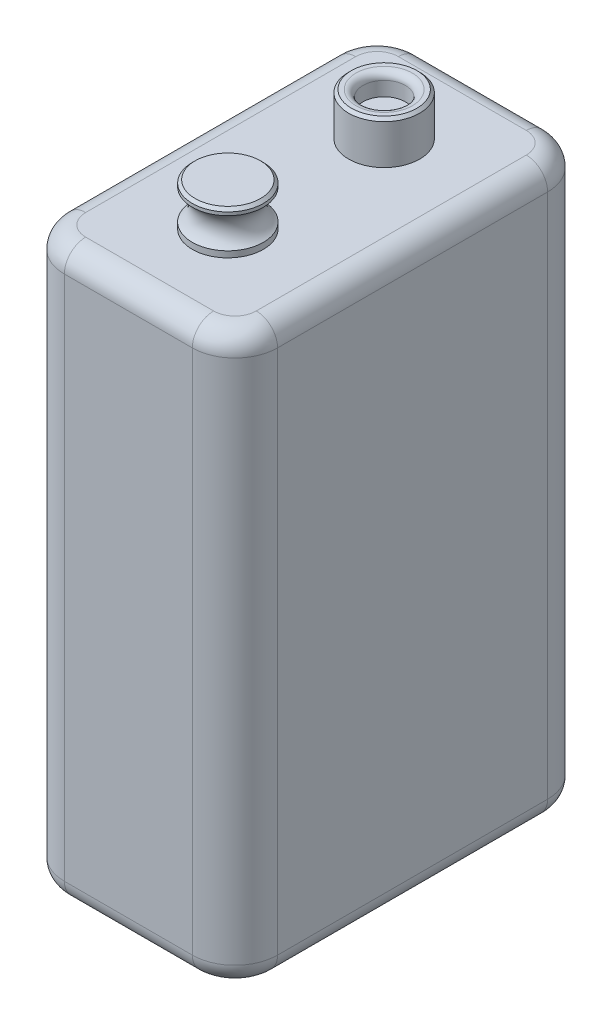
from build123d import *

# Parameters (mm, degrees)
CROQUIS1_W              = 15
CROQUIS1_H              = 25
SALIENTE_EXTRUIR1_DEPTH = 40
REDONDEO1_R             = 3
REDONDEO2_R             = 1.5
REDONDEO3_R             = 1.5
CROQUIS2_R              = 2.5
SALIENTE_EXTRUIR2_DEPTH = 3
CROQUIS3_R              = 1.487403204
CORTAR_EXTRUIR1_DEPTH   = 1.5
REDONDEO4_R             = 0.5
CHAFL_N1_SIZE           = 0.2
CROQUIS4_R              = 1.299235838
CHAFL_N2_SIZE           = 0.2


with BuildPart() as part:
    # Croquis1 → Saliente-Extruir1 (new body)
    with BuildSketch(Plane(origin=(0, 0, 0), x_dir=(1, 0, 0), z_dir=(0, 1, 0))):
        Rectangle(CROQUIS1_W, CROQUIS1_H)
    extrude(amount=SALIENTE_EXTRUIR1_DEPTH)

    # Redondeo1
    redondeo1_edges = [part.edges().sort_by_distance(p)[0] for p in [
        (7.5, 20, 12.5),
        (-7.5, 20, 12.5),
        (-7.5, 20, -12.5),
        (7.5, 20, -12.5),
    ]]
    fillet(redondeo1_edges, radius=REDONDEO1_R)

    # Redondeo2
    redondeo2_edges = [part.edges().sort_by_distance(p)[0] for p in [
        (-7.5, 0, 0),
        (7.5, 0, 0),
        (0, 0, 12.5),
        (0, 0, -12.5),
        (6.621320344, 0, 11.621320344),
        (-6.621320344, 0, 11.621320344),
        (6.621320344, 0, -11.621320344),
        (-6.621320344, 0, -11.621320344),
    ]]
    fillet(redondeo2_edges, radius=REDONDEO2_R)

    # Redondeo3
    redondeo3_edges = [part.edges().sort_by_distance(p)[0] for p in [
        (-7.5, 40, 0),
        (0, 40, -12.5),
        (7.5, 40, 0),
        (0, 40, 12.5),
        (6.621320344, 40, 11.621320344),
        (-6.621320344, 40, 11.621320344),
        (6.621320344, 40, -11.621320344),
        (-6.621320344, 40, -11.621320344),
    ]]
    fillet(redondeo3_edges, radius=REDONDEO3_R)

    # Croquis2 → Saliente-Extruir2 (add)
    with BuildSketch(Plane(origin=(0, 40, 0), x_dir=(1, 0, 0), z_dir=(0, 1, 0))):
        with Locations(Location((0, 5.5, 0), (0, 0, 270))):
            Circle(CROQUIS2_R)
        with Locations(Location((0, -5.5, 0), (0, 0, 90))):
            Circle(CROQUIS2_R)
    extrude(amount=SALIENTE_EXTRUIR2_DEPTH)

    # Croquis3 → Cortar-Extruir1 (cut)
    with BuildSketch(Plane(origin=(0, 43, 0), x_dir=(1, 0, 0), z_dir=(0, 1, 0))):
        with Locations(Location((0, 5.5, 0), (0, 0, 270))):
            Circle(CROQUIS3_R)
    extrude(amount=-CORTAR_EXTRUIR1_DEPTH, mode=Mode.SUBTRACT)

    # Redondeo4
    redondeo4_edges = [part.edges().sort_by_distance(p)[0] for p in [
        (0, 43, -6.987403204),
    ]]
    fillet(redondeo4_edges, radius=REDONDEO4_R)

    # Chafl_n1
    chafl_n1_edges = [part.edges().sort_by_distance(p)[0] for p in [
        (0, 43, -8),
    ]]
    chamfer(chafl_n1_edges, length=CHAFL_N1_SIZE)

    # Croquis4 → Cortar-Revoluci_n1 (revolve, cut)
    with BuildSketch(Plane(origin=(0, 0, 0), x_dir=(0, 0, -1), z_dir=(1, 0, 0))):
        with Locations((-2.260920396, 41.5)):
            Circle(CROQUIS4_R)
    revolve(axis=Axis((0, 43, 5.5), (0, -1, 0)), mode=Mode.SUBTRACT)

    # Chafl_n2
    chafl_n2_edges = [part.edges().sort_by_distance(p)[0] for p in [
        (0, 43, 8),
    ]]
    chamfer(chafl_n2_edges, length=CHAFL_N2_SIZE)


solid = part.part
